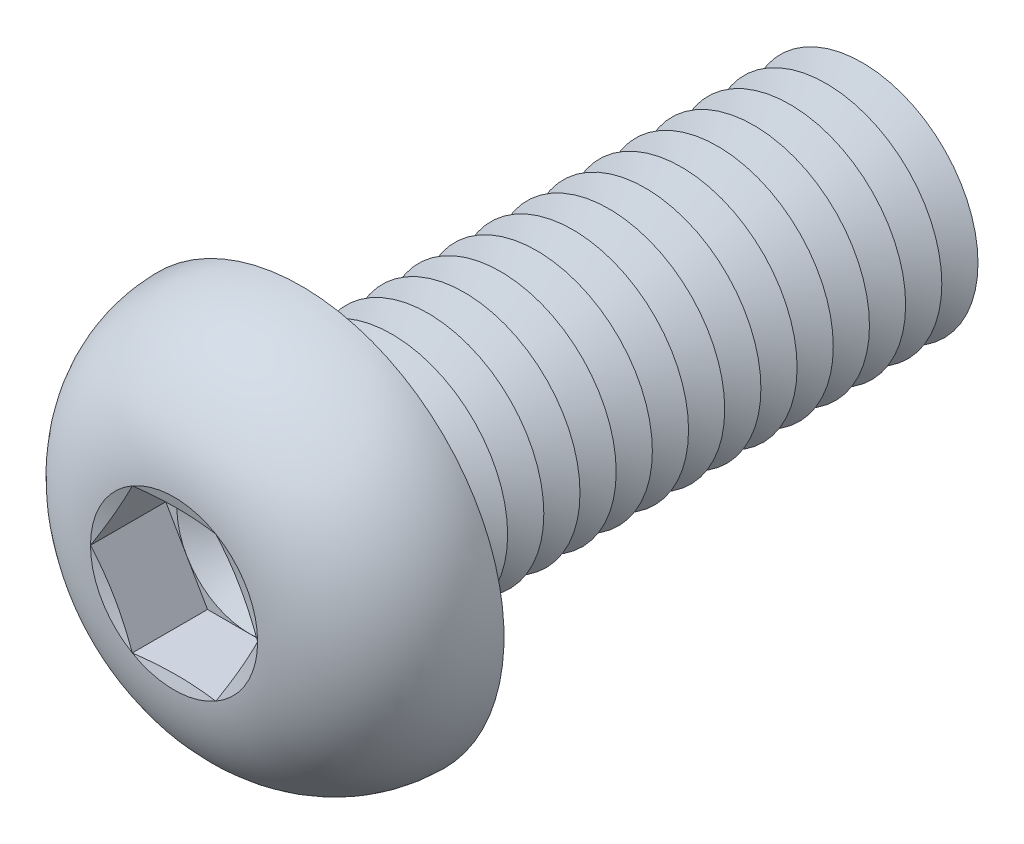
from build123d import *

# Parameters (mm, degrees)
FILLET1_R          = 0.625
LPATTERN1_COUNT    = 16
LPATTERN1_PITCH    = 1.25
CUT_EXTRUDE1_DEPTH = 2.6


with BuildPart() as part:
    # Sketch1 → Revolve1 (revolve)
    with BuildSketch(Plane(origin=(0, 0, 0), x_dir=(0, 0, -1), z_dir=(1, 0, 0)), mode=Mode.PRIVATE) as revolve1_sk:
        with BuildLine():
            Line((0, 4), (0, 7))
            ThreePointArc((0, 7), (-3.011595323, 5.81154966), (-4.4, 2.88675))
            Line((-4.4, 2.88675), (-4.013248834, 1.443375))
            Line((-4.013248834, 1.443375), (-4.4, 1.443375))
            Line((-4.4, 1.443375), (-4.4, 0))
            Line((-4.4, 0), (20, 0))
            Line((20, 0), (20, 4))
            Line((20, 4), (0, 4))
        make_face()
    revolve(revolve1_sk.sketch.rotate(Axis((0, 0, -20), (0, 0, 1)), 90), axis=Axis((0, 0, -20), (0, 0, 1)))

    # Fillet1
    fillet1_edges = [part.edges().sort_by_distance(p)[0] for p in [
        (4, 0, 0),
    ]]
    fillet(fillet1_edges, radius=FILLET1_R)

    # Sketch2 → Cut-Revolve1 (revolve, cut)
    with BuildSketch(Plane(origin=(0, 0, 0), x_dir=(0, 0, -1), z_dir=(1, 0, 0)), mode=Mode.PRIVATE) as cut_revolve1_sk:
        Polygon((19.375, 4), (20.625, 4), (20, 2.917468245), align=None)
    cut_revolve1 = revolve(cut_revolve1_sk.sketch.rotate(Axis((0, 0, -20), (0, 0, -1)), 270), axis=Axis((0, 0, -20), (0, 0, -1)), mode=Mode.SUBTRACT)

    # LPattern1: Cut-Revolve1 ×16
    with Locations(*[(0, 0, i * LPATTERN1_PITCH) for i in range(1, LPATTERN1_COUNT)]):
        add(cut_revolve1, mode=Mode.SUBTRACT)

    # Sketch3 → Cut-Extrude1 (cut)
    with BuildSketch(Plane.XY.offset(4.4)):
        Polygon((1.443375, 2.499998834), (-1.443375, 2.499998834), (-2.88675, 0), (-1.443375, -2.499998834), (1.443375, -2.499998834), (2.88675, 0), align=None)
    extrude(amount=-CUT_EXTRUDE1_DEPTH, mode=Mode.SUBTRACT)

    # Cut-Extrude2 cone 1 section (on through the dimple's axis) → Cut-Extrude2 (revolve, cut)
    with BuildSketch(Plane(origin=(0, 0, 1.8), x_dir=(0, -1, 0), z_dir=(1, 0, 0))):
        Polygon((0, 0), (2.499998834, 0), (0, 1.443375), align=None)
    revolve(axis=Axis((0, 0, 1.8), (0, 0, -1)), mode=Mode.SUBTRACT)


solid = part.part
